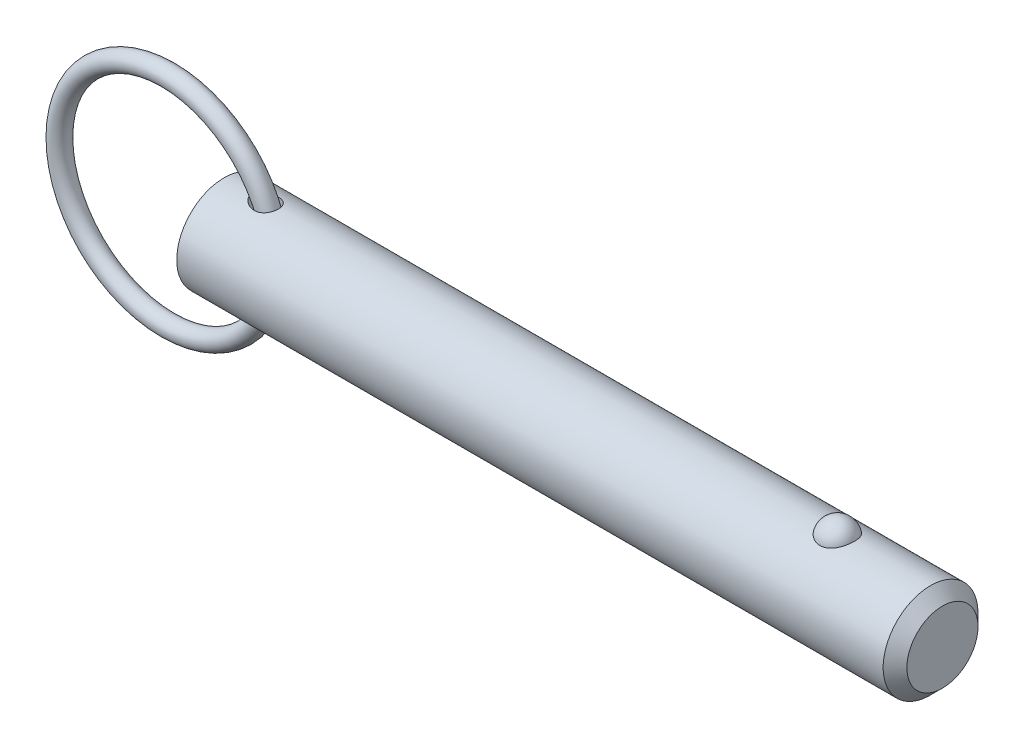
ISO-10303-21;
HEADER;
FILE_DESCRIPTION(('STEP AP214'),'2;1');
FILE_NAME('part.step','',(''),(''),'','','');
FILE_SCHEMA(('AUTOMOTIVE_DESIGN { 1 0 10303 214 1 1 1 1 }'));
ENDSEC;
DATA;
#1=APPLICATION_CONTEXT('core data for automotive mechanical design processes');
#2=APPLICATION_PROTOCOL_DEFINITION('international standard','automotive_design',2000,#1);
#3=PRODUCT_CONTEXT('',#1,'mechanical');
#4=PRODUCT('Part','Part','',(#3));
#5=PRODUCT_RELATED_PRODUCT_CATEGORY('part','',(#4));
#6=PRODUCT_DEFINITION_FORMATION('','',#4);
#7=PRODUCT_DEFINITION_CONTEXT('part definition',#1,'design');
#8=PRODUCT_DEFINITION('design','',#6,#7);
#9=PRODUCT_DEFINITION_SHAPE('','',#8);
#10=(LENGTH_UNIT() NAMED_UNIT(*) SI_UNIT(.MILLI.,.METRE.));
#11=(NAMED_UNIT(*) PLANE_ANGLE_UNIT() SI_UNIT($,.RADIAN.));
#12=(NAMED_UNIT(*) SI_UNIT($,.STERADIAN.) SOLID_ANGLE_UNIT());
#13=UNCERTAINTY_MEASURE_WITH_UNIT(LENGTH_MEASURE(1.E-05),#10,'distance_accuracy_value','');
#14=(GEOMETRIC_REPRESENTATION_CONTEXT(3) GLOBAL_UNCERTAINTY_ASSIGNED_CONTEXT((#13)) GLOBAL_UNIT_ASSIGNED_CONTEXT((#10,
#11,#12)) REPRESENTATION_CONTEXT('',''));
#15=CARTESIAN_POINT('',(0.,0.,0.));
#16=DIRECTION('',(0.,0.,1.));
#17=DIRECTION('',(1.,0.,0.));
#18=AXIS2_PLACEMENT_3D('',#15,#16,#17);
#19=CARTESIAN_POINT('',(-6.5973878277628,0.,0.));
#20=DIRECTION('',(0.,0.,1.));
#21=DIRECTION('',(1.,0.,0.));
#22=AXIS2_PLACEMENT_3D('',#19,#20,#21);
#23=TOROIDAL_SURFACE('',#22,12.7,1.111);
#24=CARTESIAN_POINT('',(7.21361217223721,0.,0.));
#25=VERTEX_POINT('',#24);
#26=VERTEX_LOOP('',#25);
#27=FACE_BOUND('',#26,.T.);
#28=ADVANCED_FACE('P0_F12',(#27),#23,.T.);
#29=CLOSED_SHELL('',(#28));
#30=MANIFOLD_SOLID_BREP('P0_B1',#29);
#31=CARTESIAN_POINT('',(0.,0.,0.));
#32=DIRECTION('',(1.,0.,0.));
#33=DIRECTION('',(0.,0.,-1.));
#34=AXIS2_PLACEMENT_3D('',#31,#32,#33);
#35=CYLINDRICAL_SURFACE('',#34,5.555);
#36=CARTESIAN_POINT('',(3.4079629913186,5.52646850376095,-0.56229074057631));
#37=CARTESIAN_POINT('',(3.45038002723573,5.51879026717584,-0.637753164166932));
#38=CARTESIAN_POINT('',(3.50032814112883,5.50998541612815,-0.70889136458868));
#39=CARTESIAN_POINT('',(3.61174203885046,5.49132550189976,-0.841353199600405));
#40=CARTESIAN_POINT('',(3.67323300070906,5.48146816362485,-0.902654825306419));
#41=CARTESIAN_POINT('',(3.80437942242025,5.46186986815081,-1.01449227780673));
#42=CARTESIAN_POINT('',(3.87396236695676,5.45212862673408,-1.06511378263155));
#43=CARTESIAN_POINT('',(4.01965973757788,5.43359578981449,-1.15594541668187));
#44=CARTESIAN_POINT('',(4.09577226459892,5.42480391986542,-1.19615855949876));
#45=CARTESIAN_POINT('',(4.26620236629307,5.40764958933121,-1.27165209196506));
#46=CARTESIAN_POINT('',(4.36143030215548,5.3996073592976,-1.30496908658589));
#47=CARTESIAN_POINT('',(4.55632904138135,5.38707461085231,-1.35578120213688));
#48=CARTESIAN_POINT('',(4.65600230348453,5.38258608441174,-1.37326745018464));
#49=CARTESIAN_POINT('',(4.85802759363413,5.37803111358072,-1.3910078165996));
#50=CARTESIAN_POINT('',(4.96039620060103,5.37800782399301,-1.39109376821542));
#51=CARTESIAN_POINT('',(5.16321961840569,5.38288845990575,-1.37209481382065));
#52=CARTESIAN_POINT('',(5.26367660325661,5.38778639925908,-1.3530331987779));
#53=CARTESIAN_POINT('',(5.44616808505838,5.40112654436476,-1.29866014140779));
#54=CARTESIAN_POINT('',(5.52893514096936,5.40904875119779,-1.26567968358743));
#55=CARTESIAN_POINT('',(5.68656142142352,5.4273273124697,-1.18484144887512));
#56=CARTESIAN_POINT('',(5.76142575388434,5.43768208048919,-1.13699336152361));
#57=CARTESIAN_POINT('',(5.8928378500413,5.45821422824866,-1.03362464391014));
#58=CARTESIAN_POINT('',(5.95048930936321,5.4682911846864,-0.979480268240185));
#59=CARTESIAN_POINT('',(6.05543937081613,5.48805232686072,-0.861887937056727));
#60=CARTESIAN_POINT('',(6.10274018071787,5.4977365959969,-0.798441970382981));
#61=CARTESIAN_POINT('',(6.18429732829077,5.51527779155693,-0.666351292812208));
#62=CARTESIAN_POINT('',(6.21893047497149,5.52318421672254,-0.597945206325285));
#63=CARTESIAN_POINT('',(6.27643902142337,5.53669785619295,-0.456146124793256));
#64=CARTESIAN_POINT('',(6.299314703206,5.54230512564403,-0.382753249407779));
#65=CARTESIAN_POINT('',(6.33280284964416,5.55061821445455,-0.232999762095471));
#66=CARTESIAN_POINT('',(6.34340498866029,5.55332159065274,-0.156636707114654));
#67=CARTESIAN_POINT('',(6.35208224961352,5.55552923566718,-0.00315477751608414));
#68=CARTESIAN_POINT('',(6.3501570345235,5.55503341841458,0.0739641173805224));
#69=CARTESIAN_POINT('',(6.33379320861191,5.55088854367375,0.22702996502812));
#70=CARTESIAN_POINT('',(6.31931424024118,5.54722931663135,0.302972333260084));
#71=CARTESIAN_POINT('',(6.27810810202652,5.53713917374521,0.451265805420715));
#72=CARTESIAN_POINT('',(6.25138106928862,5.53070828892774,0.523616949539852));
#73=CARTESIAN_POINT('',(6.18634700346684,5.51578851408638,0.662556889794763));
#74=CARTESIAN_POINT('',(6.14805666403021,5.50730259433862,0.729153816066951));
#75=CARTESIAN_POINT('',(6.0608417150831,5.4892059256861,0.854797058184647));
#76=CARTESIAN_POINT('',(6.01191805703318,5.47959527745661,0.91384404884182));
#77=CARTESIAN_POINT('',(5.90496974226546,5.46035411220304,1.0225462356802));
#78=CARTESIAN_POINT('',(5.8469816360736,5.45072382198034,1.07223745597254));
#79=CARTESIAN_POINT('',(5.72342907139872,5.43245016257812,1.16128533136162));
#80=CARTESIAN_POINT('',(5.65786492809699,5.42380675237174,1.20064241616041));
#81=CARTESIAN_POINT('',(5.52033184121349,5.40830592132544,1.26865612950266));
#82=CARTESIAN_POINT('',(5.44830127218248,5.40146883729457,1.29719236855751));
#83=CARTESIAN_POINT('',(5.30051649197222,5.39032432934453,1.34275086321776));
#84=CARTESIAN_POINT('',(5.22476137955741,5.38601752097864,1.35977031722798));
#85=CARTESIAN_POINT('',(5.06697568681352,5.38004503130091,1.3832203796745));
#86=CARTESIAN_POINT('',(4.98483834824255,5.37854992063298,1.38896799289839));
#87=CARTESIAN_POINT('',(4.82062075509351,5.37866467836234,1.38851901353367));
#88=CARTESIAN_POINT('',(4.73854053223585,5.38027567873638,1.38231806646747));
#89=CARTESIAN_POINT('',(4.5665970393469,5.38661928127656,1.35740374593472));
#90=CARTESIAN_POINT('',(4.47694676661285,5.39169506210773,1.33731128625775));
#91=CARTESIAN_POINT('',(4.30168169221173,5.40457769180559,1.28425210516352));
#92=CARTESIAN_POINT('',(4.2160714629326,5.41238755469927,1.25127117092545));
#93=CARTESIAN_POINT('',(4.04117722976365,5.43085841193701,1.16867508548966));
#94=CARTESIAN_POINT('',(3.95261220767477,5.44174460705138,1.11757796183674));
#95=CARTESIAN_POINT('',(3.78568183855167,5.46440376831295,1.00091858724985));
#96=CARTESIAN_POINT('',(3.70730710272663,5.47617590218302,0.935369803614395));
#97=CARTESIAN_POINT('',(3.5829937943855,5.49603821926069,0.809043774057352));
#98=CARTESIAN_POINT('',(3.5339020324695,5.50429522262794,0.751392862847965));
#99=CARTESIAN_POINT('',(3.44556991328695,5.51963490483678,0.628847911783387));
#100=CARTESIAN_POINT('',(3.40631385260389,5.52671944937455,0.563965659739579));
#101=CARTESIAN_POINT('',(3.34553998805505,5.5379053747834,0.439181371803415));
#102=CARTESIAN_POINT('',(3.32216705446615,5.5423057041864,0.380214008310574));
#103=CARTESIAN_POINT('',(3.2854368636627,5.54928356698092,0.259119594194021));
#104=CARTESIAN_POINT('',(3.27207322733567,5.5518622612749,0.196994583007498));
#105=CARTESIAN_POINT('',(3.25633559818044,5.5549036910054,0.0710541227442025));
#106=CARTESIAN_POINT('',(3.25400356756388,5.5553583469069,0.00723314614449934));
#107=CARTESIAN_POINT('',(3.26064251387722,5.55407150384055,-0.119787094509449));
#108=CARTESIAN_POINT('',(3.26961302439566,5.55233009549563,-0.182986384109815));
#109=CARTESIAN_POINT('',(3.29666795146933,5.54714559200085,-0.30051820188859));
#110=CARTESIAN_POINT('',(3.31373453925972,5.54389322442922,-0.355099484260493));
#111=CARTESIAN_POINT('',(3.35543396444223,5.53607951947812,-0.461174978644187));
#112=CARTESIAN_POINT('',(3.38007019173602,5.5315175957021,-0.512667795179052));
#113=CARTESIAN_POINT('',(3.4079629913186,5.52646850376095,-0.56229074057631));
#114=B_SPLINE_CURVE_WITH_KNOTS('',3,(#36,#37,#38,#39,#40,#41,#42,#43,#44,#45,#46,#47,#48,#49,
#50,#51,#52,#53,#54,#55,#56,#57,#58,#59,#60,#61,#62,#63,#64,#65,#66,#67,#68,#69,#70,#71,#72,#73,
#74,#75,#76,#77,#78,#79,#80,#81,#82,#83,#84,#85,#86,#87,#88,#89,#90,#91,#92,#93,#94,#95,#96,#97,
#98,#99,#100,#101,#102,#103,#104,#105,#106,#107,#108,#109,#110,#111,#112,#113),.UNSPECIFIED.,
.T.,.F.,(4,2,2,2,2,2,2,2,2,2,2,2,2,2,2,2,2,2,2,2,2,2,2,2,2,2,2,2,2,2,2,2,2,2,2,2,2,2,4),(0.,
0.260459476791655,0.521493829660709,0.780346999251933,1.03912513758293,1.34137402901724,
1.64379222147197,1.94913302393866,2.25410286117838,2.52092363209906,2.78757087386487,
3.0255756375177,3.26352958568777,3.49368251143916,3.72382991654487,3.9541708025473,
4.18451788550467,4.41560824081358,4.64669600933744,4.87745174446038,5.10818684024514,
5.33801446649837,5.56783253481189,5.80013729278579,6.03249854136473,6.27855081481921,
6.5246927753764,6.79963372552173,7.07487872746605,7.38193573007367,7.68870779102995,
7.91639390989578,8.14371416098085,8.33366541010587,8.52349549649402,8.71404708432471,
8.90459080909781,9.07578823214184,9.24706243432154),.UNSPECIFIED.);
#115=CARTESIAN_POINT('',(3.4079629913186,5.52646850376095,-0.56229074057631));
#116=VERTEX_POINT('',#115);
#117=EDGE_CURVE('P1_E40',#116,#116,#114,.T.);
#118=ORIENTED_EDGE('',*,*,#117,.T.);
#119=EDGE_LOOP('',(#118));
#120=FACE_BOUND('',#119,.T.);
#121=CARTESIAN_POINT('',(82.73125,0.,0.));
#122=DIRECTION('',(1.,0.,0.));
#123=DIRECTION('',(0.,0.,-1.));
#124=AXIS2_PLACEMENT_3D('',#121,#122,#123);
#125=CIRCLE('',#124,5.555);
#126=CARTESIAN_POINT('',(82.73125,0.,-5.555));
#127=VERTEX_POINT('',#126);
#128=EDGE_CURVE('P1_E25',#127,#127,#125,.T.);
#129=ORIENTED_EDGE('',*,*,#128,.F.);
#130=EDGE_LOOP('',(#129));
#131=FACE_BOUND('',#130,.T.);
#132=CARTESIAN_POINT('',(0.,0.,0.));
#133=DIRECTION('',(1.,0.,0.));
#134=DIRECTION('',(0.,0.,-1.));
#135=AXIS2_PLACEMENT_3D('',#132,#133,#134);
#136=CIRCLE('',#135,5.555);
#137=CARTESIAN_POINT('',(0.,0.,-5.555));
#138=VERTEX_POINT('',#137);
#139=EDGE_CURVE('P1_E9',#138,#138,#136,.T.);
#140=ORIENTED_EDGE('',*,*,#139,.T.);
#141=EDGE_LOOP('',(#140));
#142=FACE_BOUND('',#141,.T.);
#143=CARTESIAN_POINT('',(71.8186264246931,5.16741224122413,2.03859650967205));
#144=CARTESIAN_POINT('',(71.7129492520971,5.16740893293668,2.03859990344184));
#145=CARTESIAN_POINT('',(71.60729894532,5.17079470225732,2.03008306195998));
#146=CARTESIAN_POINT('',(71.3991419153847,5.18392795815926,1.9963072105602));
#147=CARTESIAN_POINT('',(71.2966344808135,5.19367399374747,1.9710520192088));
#148=CARTESIAN_POINT('',(71.0977710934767,5.21839168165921,1.90463997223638));
#149=CARTESIAN_POINT('',(71.0014064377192,5.23335573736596,1.86350622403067));
#150=CARTESIAN_POINT('',(70.8170804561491,5.26688076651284,1.76652592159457));
#151=CARTESIAN_POINT('',(70.7291207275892,5.28544242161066,1.71067657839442));
#152=CARTESIAN_POINT('',(70.5612654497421,5.32479845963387,1.58399959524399));
#153=CARTESIAN_POINT('',(70.4816656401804,5.34564089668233,1.51279545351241));
#154=CARTESIAN_POINT('',(70.3351290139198,5.38697258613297,1.35828584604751));
#155=CARTESIAN_POINT('',(70.268194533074,5.40746177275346,1.27497815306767));
#156=CARTESIAN_POINT('',(70.1456103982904,5.44694508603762,1.09440293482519));
#157=CARTESIAN_POINT('',(70.0905989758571,5.46583143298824,0.996677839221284));
#158=CARTESIAN_POINT('',(69.9969376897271,5.49908030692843,0.792961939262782));
#159=CARTESIAN_POINT('',(69.9582894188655,5.513442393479,0.686970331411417));
#160=CARTESIAN_POINT('',(69.8976807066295,5.536358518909,0.468019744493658));
#161=CARTESIAN_POINT('',(69.8759725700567,5.54482455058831,0.35498154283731));
#162=CARTESIAN_POINT('',(69.8506362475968,5.55473324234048,0.126595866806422));
#163=CARTESIAN_POINT('',(69.8470077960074,5.55617600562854,0.0112484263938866));
#164=CARTESIAN_POINT('',(69.8578817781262,5.55189984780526,-0.218011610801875));
#165=CARTESIAN_POINT('',(69.8723151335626,5.54620821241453,-0.331928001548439));
#166=CARTESIAN_POINT('',(69.918903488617,5.52828920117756,-0.555544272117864));
#167=CARTESIAN_POINT('',(69.9510588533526,5.5160616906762,-0.665244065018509));
#168=CARTESIAN_POINT('',(70.0324883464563,5.48630779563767,-0.877469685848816));
#169=CARTESIAN_POINT('',(70.0817816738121,5.4687754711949,-0.979987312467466));
#170=CARTESIAN_POINT('',(70.1964785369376,5.43024700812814,-1.17486975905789));
#171=CARTESIAN_POINT('',(70.2618831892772,5.4092506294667,-1.26723387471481));
#172=CARTESIAN_POINT('',(70.4075712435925,5.36600927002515,-1.43940133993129));
#173=CARTESIAN_POINT('',(70.4878859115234,5.34376173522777,-1.5191776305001));
#174=CARTESIAN_POINT('',(70.6614520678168,5.30057971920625,-1.66360338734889));
#175=CARTESIAN_POINT('',(70.7547021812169,5.27964509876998,-1.72825445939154));
#176=CARTESIAN_POINT('',(70.9493939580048,5.24205250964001,-1.8390947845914));
#177=CARTESIAN_POINT('',(71.0505900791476,5.22530519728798,-1.88568407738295));
#178=CARTESIAN_POINT('',(71.2601552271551,5.19750919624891,-1.96100802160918));
#179=CARTESIAN_POINT('',(71.3685215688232,5.18645838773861,-1.98974931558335));
#180=CARTESIAN_POINT('',(71.5834989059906,5.17184410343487,-2.02742262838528));
#181=CARTESIAN_POINT('',(71.689925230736,5.16793282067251,-2.0372760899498));
#182=CARTESIAN_POINT('',(71.9029925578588,5.1669899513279,-2.03966777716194));
#183=CARTESIAN_POINT('',(72.0096335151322,5.16995704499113,-2.03220932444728));
#184=CARTESIAN_POINT('',(72.2167730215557,5.18222383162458,-2.0007117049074));
#185=CARTESIAN_POINT('',(72.3173599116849,5.19133213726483,-1.97717337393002));
#186=CARTESIAN_POINT('',(72.5130141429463,5.21467637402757,-1.91475248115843));
#187=CARTESIAN_POINT('',(72.6080810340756,5.22891272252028,-1.87586867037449));
#188=CARTESIAN_POINT('',(72.792371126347,5.26137066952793,-1.78282713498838));
#189=CARTESIAN_POINT('',(72.8814190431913,5.27967329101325,-1.7283512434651));
#190=CARTESIAN_POINT('',(73.0492880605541,5.31817411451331,-1.60597483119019));
#191=CARTESIAN_POINT('',(73.1281068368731,5.33837274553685,-1.53807126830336));
#192=CARTESIAN_POINT('',(73.2775156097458,5.37968287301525,-1.38688970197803));
#193=CARTESIAN_POINT('',(73.3475058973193,5.40079011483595,-1.30301744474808));
#194=CARTESIAN_POINT('',(73.4730125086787,5.44074401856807,-1.12458170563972));
#195=CARTESIAN_POINT('',(73.5285262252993,5.4595902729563,-1.03001630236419));
#196=CARTESIAN_POINT('',(73.6255507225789,5.49369849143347,-0.829439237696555));
#197=CARTESIAN_POINT('',(73.6665483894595,5.50882422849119,-0.723155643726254));
#198=CARTESIAN_POINT('',(73.7311250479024,5.53310911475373,-0.504772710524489));
#199=CARTESIAN_POINT('',(73.7547036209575,5.54226812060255,-0.392673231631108));
#200=CARTESIAN_POINT('',(73.784013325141,5.55370358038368,-0.165459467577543));
#201=CARTESIAN_POINT('',(73.7896884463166,5.55595843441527,-0.0503368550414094));
#202=CARTESIAN_POINT('',(73.782916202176,5.55329317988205,0.179288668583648));
#203=CARTESIAN_POINT('',(73.7704690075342,5.54837313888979,0.293791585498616));
#204=CARTESIAN_POINT('',(73.7277798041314,5.53189037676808,0.518526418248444));
#205=CARTESIAN_POINT('',(73.697598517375,5.5203503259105,0.62877154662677));
#206=CARTESIAN_POINT('',(73.6200962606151,5.49182453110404,0.84231815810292));
#207=CARTESIAN_POINT('',(73.5727743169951,5.47483847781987,0.945619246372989));
#208=CARTESIAN_POINT('',(73.4617204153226,5.43710633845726,1.14281571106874));
#209=CARTESIAN_POINT('',(73.3979215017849,5.41634501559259,1.23667048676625));
#210=CARTESIAN_POINT('',(73.2553577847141,5.37334572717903,1.4118524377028));
#211=CARTESIAN_POINT('',(73.1765932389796,5.35110778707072,1.49317982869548));
#212=CARTESIAN_POINT('',(73.0064234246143,5.30779474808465,1.64049162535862));
#213=CARTESIAN_POINT('',(72.9151002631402,5.28671324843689,1.70656877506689));
#214=CARTESIAN_POINT('',(72.7217390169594,5.2480485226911,1.82201372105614));
#215=CARTESIAN_POINT('',(72.6197005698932,5.23046541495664,1.87138095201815));
#216=CARTESIAN_POINT('',(72.4036187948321,5.20042692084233,1.95335298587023));
#217=CARTESIAN_POINT('',(72.289260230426,5.18820192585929,1.98521734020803));
#218=CARTESIAN_POINT('',(72.0561307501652,5.17169804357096,2.02783294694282));
#219=CARTESIAN_POINT('',(71.9373616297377,5.16741595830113,2.03859269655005));
#220=CARTESIAN_POINT('',(71.8186264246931,5.16741224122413,2.03859650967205));
#221=B_SPLINE_CURVE_WITH_KNOTS('',3,(#143,#144,#145,#146,#147,#148,#149,#150,#151,#152,#153,
#154,#155,#156,#157,#158,#159,#160,#161,#162,#163,#164,#165,#166,#167,#168,#169,#170,#171,#172,
#173,#174,#175,#176,#177,#178,#179,#180,#181,#182,#183,#184,#185,#186,#187,#188,#189,#190,#191,
#192,#193,#194,#195,#196,#197,#198,#199,#200,#201,#202,#203,#204,#205,#206,#207,#208,#209,#210,
#211,#212,#213,#214,#215,#216,#217,#218,#219,#220),.UNSPECIFIED.,.T.,.F.,(4,2,2,2,2,2,2,2,2,2,2,
2,2,2,2,2,2,2,2,2,2,2,2,2,2,2,2,2,2,2,2,2,2,2,2,2,2,2,4),(0.,0.316595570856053,
0.633118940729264,0.949183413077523,1.26530783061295,1.59030762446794,1.91536729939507,
2.25495824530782,2.59458224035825,2.93917283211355,3.28375835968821,3.62703002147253,
3.97030875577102,4.3139732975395,4.65766166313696,5.00207904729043,5.3464598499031,
5.68270547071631,6.0188258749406,6.33808403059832,6.65728093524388,6.96696376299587,
7.27667180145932,7.59321535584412,7.90983070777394,8.24210387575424,8.57443684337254,
8.91755896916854,9.26068933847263,9.60489211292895,9.949091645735,10.2921194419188,
10.6351667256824,10.9796305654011,11.324088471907,11.666392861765,12.0087088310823,
12.3645679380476,12.7202837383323),.UNSPECIFIED.);
#222=CARTESIAN_POINT('',(71.8186264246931,5.16741224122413,2.03859650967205));
#223=VERTEX_POINT('',#222);
#224=EDGE_CURVE('P1_E34',#223,#223,#221,.T.);
#225=ORIENTED_EDGE('',*,*,#224,.T.);
#226=EDGE_LOOP('',(#225));
#227=FACE_BOUND('',#226,.T.);
#228=CARTESIAN_POINT('',(3.4079629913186,-5.52646850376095,-0.56229074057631));
#229=CARTESIAN_POINT('',(3.37716927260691,-5.53204268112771,-0.507507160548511));
#230=CARTESIAN_POINT('',(3.35034276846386,-5.53702335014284,-0.450440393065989));
#231=CARTESIAN_POINT('',(3.30606625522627,-5.54534377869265,-0.3326552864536));
#232=CARTESIAN_POINT('',(3.28860803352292,-5.5486849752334,-0.271940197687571));
#233=CARTESIAN_POINT('',(3.26421203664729,-5.55337514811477,-0.148013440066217));
#234=CARTESIAN_POINT('',(3.25732647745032,-5.55471423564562,-0.0847909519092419));
#235=CARTESIAN_POINT('',(3.25480623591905,-5.5552029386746,0.0418913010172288));
#236=CARTESIAN_POINT('',(3.25917102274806,-5.55435265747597,0.105351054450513));
#237=CARTESIAN_POINT('',(3.27824306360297,-5.55067444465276,0.227039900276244));
#238=CARTESIAN_POINT('',(3.29237198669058,-5.54795714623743,0.285365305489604));
#239=CARTESIAN_POINT('',(3.32941044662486,-5.54094262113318,0.399033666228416));
#240=CARTESIAN_POINT('',(3.3523223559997,-5.53664496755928,0.454375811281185));
#241=CARTESIAN_POINT('',(3.40768868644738,-5.52648234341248,0.56509977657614));
#242=CARTESIAN_POINT('',(3.44072521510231,-5.52052470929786,0.620179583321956));
#243=CARTESIAN_POINT('',(3.51400705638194,-5.50771567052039,0.725188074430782));
#244=CARTESIAN_POINT('',(3.55425830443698,-5.50086353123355,0.775112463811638));
#245=CARTESIAN_POINT('',(3.66122818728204,-5.48337209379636,0.891977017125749));
#246=CARTESIAN_POINT('',(3.73142715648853,-5.47248221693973,0.955709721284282));
#247=CARTESIAN_POINT('',(3.88137100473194,-5.45112279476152,1.07085228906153));
#248=CARTESIAN_POINT('',(3.96113047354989,-5.44065392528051,1.12224294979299));
#249=CARTESIAN_POINT('',(4.12858826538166,-5.42121387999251,1.21269344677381));
#250=CARTESIAN_POINT('',(4.21635930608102,-5.41225908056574,1.25162207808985));
#251=CARTESIAN_POINT('',(4.39702156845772,-5.39704895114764,1.31566440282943));
#252=CARTESIAN_POINT('',(4.48991226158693,-5.39079334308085,1.34077951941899));
#253=CARTESIAN_POINT('',(4.68604255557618,-5.38154547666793,1.37745897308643));
#254=CARTESIAN_POINT('',(4.78952677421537,-5.37884317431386,1.38782444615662));
#255=CARTESIAN_POINT('',(4.9967070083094,-5.3783992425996,1.38955482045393));
#256=CARTESIAN_POINT('',(5.10040282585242,-5.380654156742,1.380932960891));
#257=CARTESIAN_POINT('',(5.29344112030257,-5.3896561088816,1.34533259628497));
#258=CARTESIAN_POINT('',(5.38316618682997,-5.39591960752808,1.32032381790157));
#259=CARTESIAN_POINT('',(5.55593681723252,-5.41176992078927,1.25376768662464));
#260=CARTESIAN_POINT('',(5.63898852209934,-5.42135363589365,1.2122357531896));
#261=CARTESIAN_POINT('',(5.78518175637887,-5.4411584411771,1.1197110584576));
#262=CARTESIAN_POINT('',(5.84951468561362,-5.45115126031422,1.07054233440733));
#263=CARTESIAN_POINT('',(5.96832363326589,-5.47143247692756,0.961516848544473));
#264=CARTESIAN_POINT('',(6.02280238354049,-5.48172079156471,0.901663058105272));
#265=CARTESIAN_POINT('',(6.11773365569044,-5.50082367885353,0.776380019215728));
#266=CARTESIAN_POINT('',(6.15876077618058,-5.50968670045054,0.711392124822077));
#267=CARTESIAN_POINT('',(6.22940016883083,-5.52555592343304,0.575278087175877));
#268=CARTESIAN_POINT('',(6.25901321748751,-5.53256225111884,0.504152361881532));
#269=CARTESIAN_POINT('',(6.30603044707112,-5.54392803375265,0.358090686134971));
#270=CARTESIAN_POINT('',(6.32348246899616,-5.54829785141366,0.283170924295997));
#271=CARTESIAN_POINT('',(6.34598368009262,-5.5539654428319,0.131376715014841));
#272=CARTESIAN_POINT('',(6.35103253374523,-5.55526313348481,0.054502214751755));
#273=CARTESIAN_POINT('',(6.34861245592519,-5.55464639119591,-0.0993401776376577));
#274=CARTESIAN_POINT('',(6.34109421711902,-5.5527193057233,-0.176307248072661));
#275=CARTESIAN_POINT('',(6.31360904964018,-5.54583593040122,-0.327847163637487));
#276=CARTESIAN_POINT('',(6.29364207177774,-5.54087962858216,-0.402419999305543));
#277=CARTESIAN_POINT('',(6.24170966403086,-5.52847553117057,-0.547041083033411));
#278=CARTESIAN_POINT('',(6.20974488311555,-5.52102787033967,-0.617089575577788));
#279=CARTESIAN_POINT('',(6.13458425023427,-5.5044595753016,-0.750655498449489));
#280=CARTESIAN_POINT('',(6.09138916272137,-5.49533905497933,-0.814173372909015));
#281=CARTESIAN_POINT('',(5.99508306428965,-5.47647644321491,-0.932642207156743));
#282=CARTESIAN_POINT('',(5.94201288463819,-5.46673701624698,-0.987626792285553));
#283=CARTESIAN_POINT('',(5.82732079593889,-5.4476756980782,-1.08787197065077));
#284=CARTESIAN_POINT('',(5.76569959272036,-5.43835377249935,-1.133133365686));
#285=CARTESIAN_POINT('',(5.63545565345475,-5.42108746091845,-1.2130627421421));
#286=CARTESIAN_POINT('',(5.56680798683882,-5.41314827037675,-1.24769112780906));
#287=CARTESIAN_POINT('',(5.42470366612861,-5.39946749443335,-1.30562834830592));
#288=CARTESIAN_POINT('',(5.35124627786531,-5.39372624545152,-1.32893545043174));
#289=CARTESIAN_POINT('',(5.19834649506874,-5.38471871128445,-1.36498831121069));
#290=CARTESIAN_POINT('',(5.11878242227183,-5.38156800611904,-1.37724301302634));
#291=CARTESIAN_POINT('',(4.95867408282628,-5.37830368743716,-1.38993264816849));
#292=CARTESIAN_POINT('',(4.87812945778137,-5.37819121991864,-1.39036312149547));
#293=CARTESIAN_POINT('',(4.70952450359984,-5.38096665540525,-1.37958681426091));
#294=CARTESIAN_POINT('',(4.62154757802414,-5.38416579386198,-1.36717293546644));
#295=CARTESIAN_POINT('',(4.44844201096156,-5.39350862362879,-1.32983172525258));
#296=CARTESIAN_POINT('',(4.36331534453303,-5.39965431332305,-1.30489590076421));
#297=CARTESIAN_POINT('',(4.18705584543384,-5.41508127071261,-1.23943340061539));
#298=CARTESIAN_POINT('',(4.09653169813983,-5.42466147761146,-1.19732979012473));
#299=CARTESIAN_POINT('',(3.92355621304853,-5.44542654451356,-1.09903394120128));
#300=CARTESIAN_POINT('',(3.84111059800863,-5.45661252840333,-1.04283181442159));
#301=CARTESIAN_POINT('',(3.69303712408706,-5.47835672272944,-0.921492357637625));
#302=CARTESIAN_POINT('',(3.62661543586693,-5.4888999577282,-0.857326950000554));
#303=CARTESIAN_POINT('',(3.50663841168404,-5.50887375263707,-0.717815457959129));
#304=CARTESIAN_POINT('',(3.45304856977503,-5.51830726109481,-0.642500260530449));
#305=CARTESIAN_POINT('',(3.4079629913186,-5.52646850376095,-0.56229074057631));
#306=B_SPLINE_CURVE_WITH_KNOTS('',3,(#228,#229,#230,#231,#232,#233,#234,#235,#236,#237,#238,
#239,#240,#241,#242,#243,#244,#245,#246,#247,#248,#249,#250,#251,#252,#253,#254,#255,#256,#257,
#258,#259,#260,#261,#262,#263,#264,#265,#266,#267,#268,#269,#270,#271,#272,#273,#274,#275,#276,
#277,#278,#279,#280,#281,#282,#283,#284,#285,#286,#287,#288,#289,#290,#291,#292,#293,#294,#295,
#296,#297,#298,#299,#300,#301,#302,#303,#304,#305),.UNSPECIFIED.,.T.,.F.,(4,2,2,2,2,2,2,2,2,2,2,
2,2,2,2,2,2,2,2,2,2,2,2,2,2,2,2,2,2,2,2,2,2,2,2,2,2,2,4),(0.,0.189054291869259,
0.377942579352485,0.567760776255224,0.757570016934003,0.937004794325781,1.11648807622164,
1.30929480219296,1.50226088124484,1.78704908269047,2.07227755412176,2.3604171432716,
2.64852704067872,2.95892962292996,3.26911584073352,3.5475451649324,3.82571526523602,
4.06921935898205,4.31265584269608,4.54364944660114,4.77462733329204,5.00469135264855,
5.23476159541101,5.46573664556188,5.69671260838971,5.92767607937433,6.15862383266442,
6.38863707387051,6.61863134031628,6.84947196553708,7.08034790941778,7.32103794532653,
7.56181876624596,7.82747997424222,8.09332161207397,8.39289891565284,8.69268692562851,
8.97023931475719,9.24703674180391),.UNSPECIFIED.);
#307=CARTESIAN_POINT('',(3.4079629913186,-5.52646850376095,-0.56229074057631));
#308=VERTEX_POINT('',#307);
#309=EDGE_CURVE('P1_E17',#308,#308,#306,.T.);
#310=ORIENTED_EDGE('',*,*,#309,.T.);
#311=EDGE_LOOP('',(#310));
#312=FACE_BOUND('',#311,.T.);
#313=ADVANCED_FACE('P1_F13',(#120,#131,#142,#227,#312),#35,.T.);
#314=CARTESIAN_POINT('',(0.,0.,0.));
#315=DIRECTION('',(-1.,0.,0.));
#316=DIRECTION('',(0.,0.,1.));
#317=AXIS2_PLACEMENT_3D('',#314,#315,#316);
#318=PLANE('',#317);
#319=ORIENTED_EDGE('',*,*,#139,.F.);
#320=EDGE_LOOP('',(#319));
#321=FACE_BOUND('',#320,.T.);
#322=ADVANCED_FACE('P1_F15',(#321),#318,.T.);
#323=CARTESIAN_POINT('',(84.12,0.,0.));
#324=DIRECTION('',(-1.,0.,0.));
#325=DIRECTION('',(0.,0.,1.));
#326=AXIS2_PLACEMENT_3D('',#323,#324,#325);
#327=CONICAL_SURFACE('',#326,4.16625000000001,0.785398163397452);
#328=ORIENTED_EDGE('',*,*,#128,.T.);
#329=EDGE_LOOP('',(#328));
#330=FACE_BOUND('',#329,.T.);
#331=CARTESIAN_POINT('',(84.12,0.,0.));
#332=DIRECTION('',(1.,0.,0.));
#333=DIRECTION('',(0.,0.,-1.));
#334=AXIS2_PLACEMENT_3D('',#331,#332,#333);
#335=CIRCLE('',#334,4.16625000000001);
#336=CARTESIAN_POINT('',(84.12,0.,-4.16625000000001));
#337=VERTEX_POINT('',#336);
#338=EDGE_CURVE('P1_E30',#337,#337,#335,.T.);
#339=ORIENTED_EDGE('',*,*,#338,.F.);
#340=EDGE_LOOP('',(#339));
#341=FACE_BOUND('',#340,.T.);
#342=ADVANCED_FACE('P1_F55',(#330,#341),#327,.T.);
#343=CARTESIAN_POINT('',(84.12,4.16625000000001,0.));
#344=DIRECTION('',(1.,0.,0.));
#345=DIRECTION('',(0.,0.,-1.));
#346=AXIS2_PLACEMENT_3D('',#343,#344,#345);
#347=PLANE('',#346);
#348=ORIENTED_EDGE('',*,*,#338,.T.);
#349=EDGE_LOOP('',(#348));
#350=FACE_BOUND('',#349,.T.);
#351=ADVANCED_FACE('P1_F51',(#350),#347,.T.);
#352=CARTESIAN_POINT('',(71.8186264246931,4.9995,0.));
#353=DIRECTION('',(-1.,0.,0.));
#354=DIRECTION('',(0.,1.,0.));
#355=AXIS2_PLACEMENT_3D('',#352,#353,#354);
#356=SPHERICAL_SURFACE('',#355,2.04549999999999);
#357=ORIENTED_EDGE('',*,*,#224,.F.);
#358=EDGE_LOOP('',(#357));
#359=FACE_BOUND('',#358,.T.);
#360=ADVANCED_FACE('P1_F46',(#359),#356,.T.);
#361=CARTESIAN_POINT('',(-6.59738782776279,0.,0.));
#362=DIRECTION('',(0.,0.,1.));
#363=DIRECTION('',(1.,0.,0.));
#364=AXIS2_PLACEMENT_3D('',#361,#362,#363);
#365=TOROIDAL_SURFACE('',#364,12.7,1.38875);
#366=ORIENTED_EDGE('',*,*,#309,.F.);
#367=EDGE_LOOP('',(#366));
#368=FACE_BOUND('',#367,.T.);
#369=ORIENTED_EDGE('',*,*,#117,.F.);
#370=EDGE_LOOP('',(#369));
#371=FACE_BOUND('',#370,.T.);
#372=ADVANCED_FACE('P1_F50',(#368,#371),#365,.F.);
#373=CLOSED_SHELL('',(#313,#322,#342,#351,#360,#372));
#374=MANIFOLD_SOLID_BREP('P1_B1',#373);
#375=ADVANCED_BREP_SHAPE_REPRESENTATION('',(#18,#30,#374),#14);
#376=SHAPE_DEFINITION_REPRESENTATION(#9,#375);
ENDSEC;
END-ISO-10303-21;
